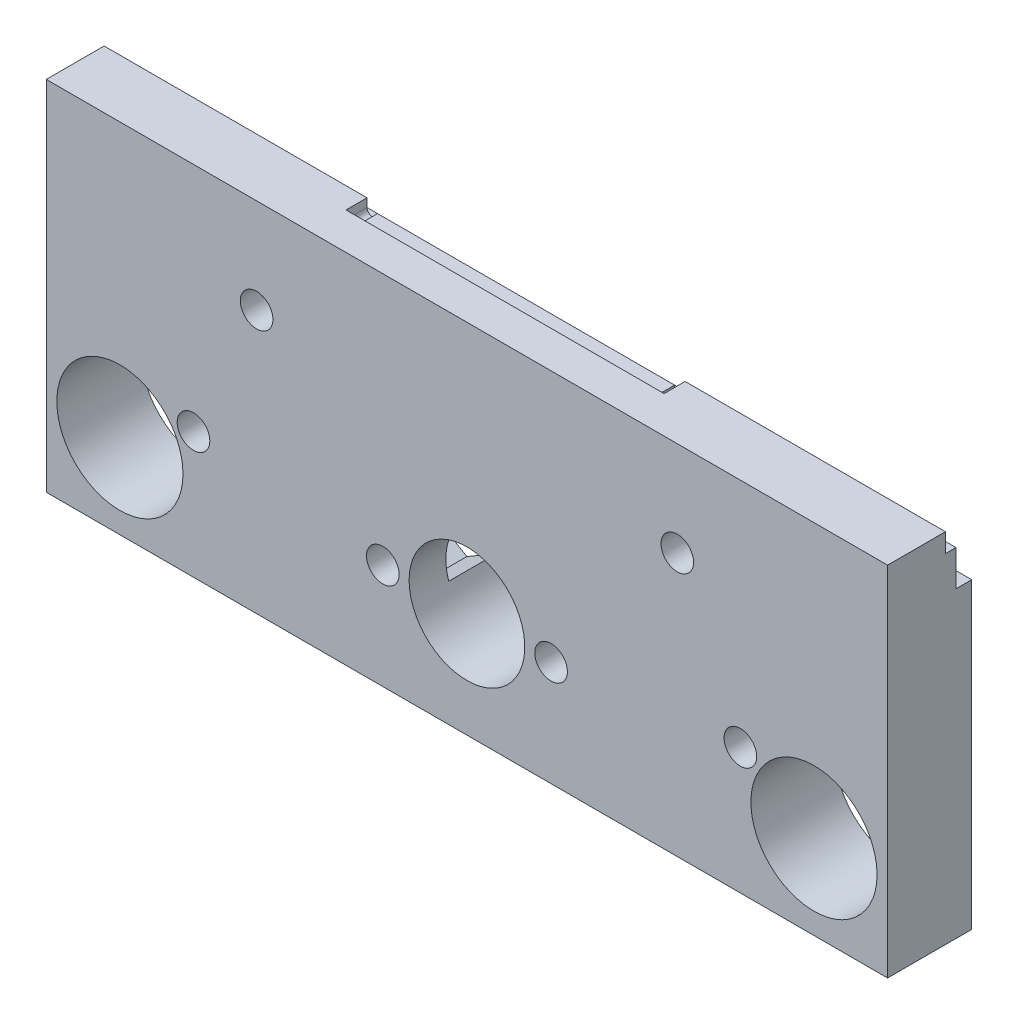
from build123d import *

# Parameters (mm, degrees)
SKETCH_2_W           = 80
SKETCH_2_H           = 34
SKETCH_2_R           = 6
SKETCH_2_R_2         = 4.05
EXTRUDE_1_DEPTH      = 8
CUT_EXTRUDE_2_DEPTH  = 88.292611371
SKETCH_5_R           = 1.55
CUT_EXTRUDE_3_DEPTH  = 88.292611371
CUT_EXTRUDE_5_DEPTH  = 4.5
SKETCH_11_R          = 1.55
CUT_EXTRUDE_7_DEPTH  = 88.292611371
CUT_EXTRUDE_11_DEPTH = 2
SKETCH_22_R          = 1.55
CUT_EXTRUDE_13_DEPTH = 88.292611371
SKETCH_20_R          = 5.5
CUT_EXTRUDE_14_DEPTH = 88.292611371


with BuildPart() as part:
    # Sketch 2 → Extrude 1 (new body)
    with BuildSketch(Plane.XY):
        with Locations((40, 17)):
            Rectangle(SKETCH_2_W, SKETCH_2_H)
        with Locations((7, 8)):
            Circle(SKETCH_2_R, mode=Mode.SUBTRACT)
        with Locations((40, 10)):
            Circle(SKETCH_2_R_2, mode=Mode.SUBTRACT)
        with Locations((73, 8)):
            Circle(SKETCH_2_R, mode=Mode.SUBTRACT)
    extrude(amount=EXTRUDE_1_DEPTH)

    # Sketch 4 → Cut-Extrude 2 (cut, through all)
    with BuildSketch(Plane(origin=(80, 0, 0), x_dir=(0, 0, -1), z_dir=(1, 0, 0))):
        Polygon((-1.5, 32.2), (-2.5, 32.2), (-2.5, 34), (0, 34), (0, 28.8), (-1.5, 28.8), align=None)
    extrude(amount=-CUT_EXTRUDE_2_DEPTH, mode=Mode.SUBTRACT)

    # Sketch 5 → Cut-Extrude 3 (cut, through all)
    with BuildSketch(Plane.XY.offset(8)):
        with Locations((48, 10)):
            Circle(SKETCH_5_R)
        with Locations((32, 10)):
            Circle(SKETCH_5_R)
    extrude(amount=-CUT_EXTRUDE_3_DEPTH, mode=Mode.SUBTRACT)

    # Sketch 8 → Cut-Extrude 5 (cut)
    with BuildSketch(Plane(origin=(0, 0, 0), x_dir=(-1, 0, 0), z_dir=(0, 0, -1))):
        Polygon((-45.15, 8.354551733), (-45.15, 11.645448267), (-48, 13.290896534), (-50.85, 11.645448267), (-50.85, 8.354551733), (-48, 6.709103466), align=None)
        Polygon((-34.85, 8.354551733), (-32, 6.709103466), (-29.15, 8.354551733), (-29.15, 11.645448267), (-32, 13.290896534), (-34.85, 11.645448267), align=None)
    extrude(amount=-CUT_EXTRUDE_5_DEPTH, mode=Mode.SUBTRACT)

    # Sketch 11 → Cut-Extrude 7 (cut, through all)
    with BuildSketch(Plane(origin=(0, 0, 0), x_dir=(-1, 0, 0), z_dir=(0, 0, -1))):
        with Locations((-60, 25)):
            Circle(SKETCH_11_R)
        with Locations((-20, 25)):
            Circle(SKETCH_11_R)
    extrude(amount=-CUT_EXTRUDE_7_DEPTH, mode=Mode.SUBTRACT)

    # Sketch 19 → Cut-Extrude 11 (cut)
    with BuildSketch(Plane(origin=(0, 0, 2.5), x_dir=(-1, 0, 0), z_dir=(0, 0, -1))):
        with BuildLine():
            Line((-25, 34), (-55.247938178, 34))
            Line((-55.247938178, 34), (-55.247938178, 33.2))
            ThreePointArc((-55.247938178, 33.2), (-54.747938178, 32.7), (-54.247938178, 33.2))
            Line((-54.247938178, 33.2), (-26, 33.2))
            ThreePointArc((-26, 33.2), (-25.5, 32.7), (-25, 33.2))
            Line((-25, 33.2), (-25, 34))
        make_face()
    extrude(amount=-CUT_EXTRUDE_11_DEPTH, mode=Mode.SUBTRACT)

    # Sketch 22 → Cut-Extrude 13 (cut, through all)
    with BuildSketch(Plane(origin=(0, 0, 0), x_dir=(-1, 0, 0), z_dir=(0, 0, -1))):
        with Locations((-66, 12)):
            Circle(SKETCH_22_R)
        with Locations(Location((-14, 12, 0), (0, 0, 180))):
            Circle(SKETCH_22_R)
    extrude(amount=-CUT_EXTRUDE_13_DEPTH, mode=Mode.SUBTRACT)

    # Sketch 20 → Cut-Extrude 14 (cut, through all)
    with BuildSketch(Plane(origin=(0, 0, 0), x_dir=(-1, 0, 0), z_dir=(0, 0, -1))):
        with Locations((-40, 10)):
            Circle(SKETCH_20_R)
    extrude(amount=-CUT_EXTRUDE_14_DEPTH, mode=Mode.SUBTRACT)


solid = part.part
